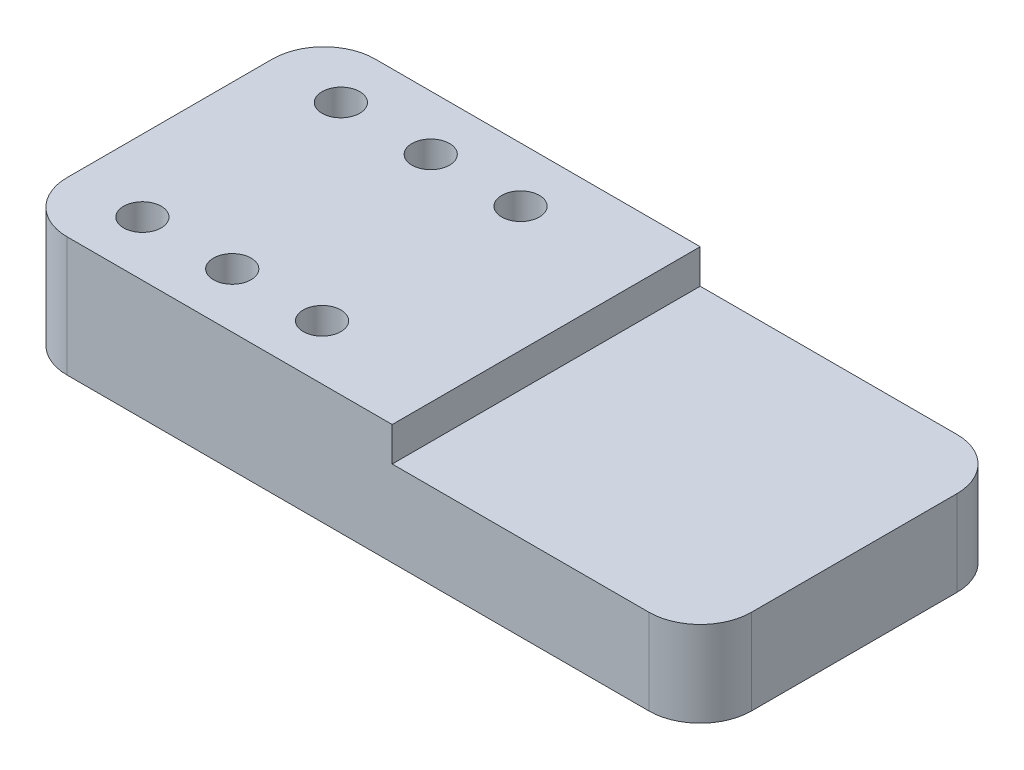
ISO-10303-21;
HEADER;
FILE_DESCRIPTION(('STEP AP214'),'2;1');
FILE_NAME('part.step','',(''),(''),'','','');
FILE_SCHEMA(('AUTOMOTIVE_DESIGN { 1 0 10303 214 1 1 1 1 }'));
ENDSEC;
DATA;
#1=APPLICATION_CONTEXT('core data for automotive mechanical design processes');
#2=APPLICATION_PROTOCOL_DEFINITION('international standard','automotive_design',2000,#1);
#3=PRODUCT_CONTEXT('',#1,'mechanical');
#4=PRODUCT('Part','Part','',(#3));
#5=PRODUCT_RELATED_PRODUCT_CATEGORY('part','',(#4));
#6=PRODUCT_DEFINITION_FORMATION('','',#4);
#7=PRODUCT_DEFINITION_CONTEXT('part definition',#1,'design');
#8=PRODUCT_DEFINITION('design','',#6,#7);
#9=PRODUCT_DEFINITION_SHAPE('','',#8);
#10=(LENGTH_UNIT() NAMED_UNIT(*) SI_UNIT(.MILLI.,.METRE.));
#11=(NAMED_UNIT(*) PLANE_ANGLE_UNIT() SI_UNIT($,.RADIAN.));
#12=(NAMED_UNIT(*) SI_UNIT($,.STERADIAN.) SOLID_ANGLE_UNIT());
#13=UNCERTAINTY_MEASURE_WITH_UNIT(LENGTH_MEASURE(1.E-05),#10,'distance_accuracy_value','');
#14=(GEOMETRIC_REPRESENTATION_CONTEXT(3) GLOBAL_UNCERTAINTY_ASSIGNED_CONTEXT((#13)) GLOBAL_UNIT_ASSIGNED_CONTEXT((#10,
#11,#12)) REPRESENTATION_CONTEXT('',''));
#15=CARTESIAN_POINT('',(0.,0.,0.));
#16=DIRECTION('',(0.,0.,1.));
#17=DIRECTION('',(1.,0.,0.));
#18=AXIS2_PLACEMENT_3D('',#15,#16,#17);
#19=CARTESIAN_POINT('',(-200.,70.,90.));
#20=DIRECTION('',(1.,0.,0.));
#21=DIRECTION('',(0.,0.,-1.));
#22=AXIS2_PLACEMENT_3D('',#19,#20,#21);
#23=PLANE('',#22);
#24=DIRECTION('',(0.,0.,-1.));
#25=VECTOR('',#24,1.);
#26=CARTESIAN_POINT('',(-200.,70.,90.));
#27=LINE('',#26,#25);
#28=CARTESIAN_POINT('',(-200.,70.,60.000000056));
#29=VERTEX_POINT('',#28);
#30=CARTESIAN_POINT('',(-200.,70.,-60.000000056));
#31=VERTEX_POINT('',#30);
#32=EDGE_CURVE('E141',#29,#31,#27,.T.);
#33=ORIENTED_EDGE('',*,*,#32,.T.);
#34=DIRECTION('',(0.,-1.,0.));
#35=VECTOR('',#34,1.);
#36=CARTESIAN_POINT('',(-200.,70.,-60.000000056));
#37=LINE('',#36,#35);
#38=CARTESIAN_POINT('',(-200.,0.,-60.000000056));
#39=VERTEX_POINT('',#38);
#40=EDGE_CURVE('E190',#31,#39,#37,.T.);
#41=ORIENTED_EDGE('',*,*,#40,.T.);
#42=DIRECTION('',(0.,0.,-1.));
#43=VECTOR('',#42,1.);
#44=CARTESIAN_POINT('',(-200.,0.,90.));
#45=LINE('',#44,#43);
#46=CARTESIAN_POINT('',(-200.,0.,60.000000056));
#47=VERTEX_POINT('',#46);
#48=EDGE_CURVE('E161',#47,#39,#45,.T.);
#49=ORIENTED_EDGE('',*,*,#48,.F.);
#50=DIRECTION('',(0.,-1.,0.));
#51=VECTOR('',#50,1.);
#52=CARTESIAN_POINT('',(-200.,70.,60.000000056));
#53=LINE('',#52,#51);
#54=EDGE_CURVE('E56',#47,#29,#53,.F.);
#55=ORIENTED_EDGE('',*,*,#54,.T.);
#56=EDGE_LOOP('',(#33,#41,#49,#55));
#57=FACE_BOUND('',#56,.T.);
#58=ADVANCED_FACE('F36',(#57),#23,.F.);
#59=CARTESIAN_POINT('',(-200.,0.,90.));
#60=DIRECTION('',(0.,1.,0.));
#61=DIRECTION('',(0.,0.,1.));
#62=AXIS2_PLACEMENT_3D('',#59,#60,#61);
#63=PLANE('',#62);
#64=DIRECTION('',(0.,0.,-1.));
#65=VECTOR('',#64,1.);
#66=CARTESIAN_POINT('',(200.,0.,90.));
#67=LINE('',#66,#65);
#68=CARTESIAN_POINT('',(200.,0.,60.000000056));
#69=VERTEX_POINT('',#68);
#70=CARTESIAN_POINT('',(200.,0.,-60.000000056));
#71=VERTEX_POINT('',#70);
#72=EDGE_CURVE('E158',#69,#71,#67,.T.);
#73=ORIENTED_EDGE('',*,*,#72,.F.);
#74=CARTESIAN_POINT('',(170.000000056,0.,60.000000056));
#75=DIRECTION('',(0.,1.,0.));
#76=DIRECTION('',(0.,0.,1.));
#77=AXIS2_PLACEMENT_3D('',#74,#75,#76);
#78=CIRCLE('',#77,29.999999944);
#79=CARTESIAN_POINT('',(170.000000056,0.,90.));
#80=VERTEX_POINT('',#79);
#81=EDGE_CURVE('E183',#69,#80,#78,.F.);
#82=ORIENTED_EDGE('',*,*,#81,.T.);
#83=DIRECTION('',(1.,0.,0.));
#84=VECTOR('',#83,1.);
#85=CARTESIAN_POINT('',(-200.,0.,90.));
#86=LINE('',#85,#84);
#87=CARTESIAN_POINT('',(-170.000000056,0.,90.));
#88=VERTEX_POINT('',#87);
#89=EDGE_CURVE('E124',#88,#80,#86,.T.);
#90=ORIENTED_EDGE('',*,*,#89,.F.);
#91=CARTESIAN_POINT('',(-170.000000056,0.,60.000000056));
#92=DIRECTION('',(0.,1.,0.));
#93=DIRECTION('',(0.,0.,1.));
#94=AXIS2_PLACEMENT_3D('',#91,#92,#93);
#95=CIRCLE('',#94,29.999999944);
#96=EDGE_CURVE('E177',#88,#47,#95,.F.);
#97=ORIENTED_EDGE('',*,*,#96,.T.);
#98=ORIENTED_EDGE('',*,*,#48,.T.);
#99=CARTESIAN_POINT('',(-170.000000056,0.,-60.000000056));
#100=DIRECTION('',(0.,1.,0.));
#101=DIRECTION('',(0.,0.,1.));
#102=AXIS2_PLACEMENT_3D('',#99,#100,#101);
#103=CIRCLE('',#102,29.999999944);
#104=CARTESIAN_POINT('',(-170.000000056,0.,-90.));
#105=VERTEX_POINT('',#104);
#106=EDGE_CURVE('E179',#39,#105,#103,.F.);
#107=ORIENTED_EDGE('',*,*,#106,.T.);
#108=DIRECTION('',(1.,0.,0.));
#109=VECTOR('',#108,1.);
#110=CARTESIAN_POINT('',(-200.,0.,-90.));
#111=LINE('',#110,#109);
#112=CARTESIAN_POINT('',(170.000000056,0.,-90.));
#113=VERTEX_POINT('',#112);
#114=EDGE_CURVE('E145',#105,#113,#111,.T.);
#115=ORIENTED_EDGE('',*,*,#114,.T.);
#116=CARTESIAN_POINT('',(170.000000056,0.,-60.000000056));
#117=DIRECTION('',(0.,1.,0.));
#118=DIRECTION('',(0.,0.,1.));
#119=AXIS2_PLACEMENT_3D('',#116,#117,#118);
#120=CIRCLE('',#119,29.999999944);
#121=EDGE_CURVE('E181',#113,#71,#120,.F.);
#122=ORIENTED_EDGE('',*,*,#121,.T.);
#123=EDGE_LOOP('',(#73,#82,#90,#97,#98,#107,#115,#122));
#124=FACE_BOUND('',#123,.T.);
#125=ADVANCED_FACE('F199',(#124),#63,.F.);
#126=CARTESIAN_POINT('',(200.,50.,90.));
#127=DIRECTION('',(-1.,0.,0.));
#128=DIRECTION('',(0.,0.,1.));
#129=AXIS2_PLACEMENT_3D('',#126,#127,#128);
#130=PLANE('',#129);
#131=DIRECTION('',(0.,0.,-1.));
#132=VECTOR('',#131,1.);
#133=CARTESIAN_POINT('',(200.,50.,90.));
#134=LINE('',#133,#132);
#135=CARTESIAN_POINT('',(200.,50.,60.000000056));
#136=VERTEX_POINT('',#135);
#137=CARTESIAN_POINT('',(200.,50.,-60.000000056));
#138=VERTEX_POINT('',#137);
#139=EDGE_CURVE('E133',#136,#138,#134,.T.);
#140=ORIENTED_EDGE('',*,*,#139,.F.);
#141=DIRECTION('',(0.,1.,0.));
#142=VECTOR('',#141,1.);
#143=CARTESIAN_POINT('',(200.,0.,60.000000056));
#144=LINE('',#143,#142);
#145=EDGE_CURVE('E175',#136,#69,#144,.F.);
#146=ORIENTED_EDGE('',*,*,#145,.T.);
#147=ORIENTED_EDGE('',*,*,#72,.T.);
#148=DIRECTION('',(0.,1.,0.));
#149=VECTOR('',#148,1.);
#150=CARTESIAN_POINT('',(200.,50.,-60.000000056));
#151=LINE('',#150,#149);
#152=EDGE_CURVE('E172',#71,#138,#151,.T.);
#153=ORIENTED_EDGE('',*,*,#152,.T.);
#154=EDGE_LOOP('',(#140,#146,#147,#153));
#155=FACE_BOUND('',#154,.T.);
#156=ADVANCED_FACE('F216',(#155),#130,.F.);
#157=CARTESIAN_POINT('',(20.,50.,90.));
#158=DIRECTION('',(0.,-1.,0.));
#159=DIRECTION('',(0.,0.,-1.));
#160=AXIS2_PLACEMENT_3D('',#157,#158,#159);
#161=PLANE('',#160);
#162=DIRECTION('',(-1.,0.,0.));
#163=VECTOR('',#162,1.);
#164=CARTESIAN_POINT('',(20.,50.,90.));
#165=LINE('',#164,#163);
#166=CARTESIAN_POINT('',(170.000000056,50.,90.));
#167=VERTEX_POINT('',#166);
#168=CARTESIAN_POINT('',(20.,50.,90.));
#169=VERTEX_POINT('',#168);
#170=EDGE_CURVE('E113',#167,#169,#165,.T.);
#171=ORIENTED_EDGE('',*,*,#170,.F.);
#172=CARTESIAN_POINT('',(170.000000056,50.,60.000000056));
#173=DIRECTION('',(0.,-1.,0.));
#174=DIRECTION('',(0.,0.,-1.));
#175=AXIS2_PLACEMENT_3D('',#172,#173,#174);
#176=CIRCLE('',#175,29.999999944);
#177=EDGE_CURVE('E170',#167,#136,#176,.F.);
#178=ORIENTED_EDGE('',*,*,#177,.T.);
#179=ORIENTED_EDGE('',*,*,#139,.T.);
#180=CARTESIAN_POINT('',(170.000000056,50.,-60.000000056));
#181=DIRECTION('',(0.,-1.,0.));
#182=DIRECTION('',(0.,0.,-1.));
#183=AXIS2_PLACEMENT_3D('',#180,#181,#182);
#184=CIRCLE('',#183,29.999999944);
#185=CARTESIAN_POINT('',(170.000000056,50.,-90.));
#186=VERTEX_POINT('',#185);
#187=EDGE_CURVE('E168',#138,#186,#184,.F.);
#188=ORIENTED_EDGE('',*,*,#187,.T.);
#189=DIRECTION('',(-1.,0.,0.));
#190=VECTOR('',#189,1.);
#191=CARTESIAN_POINT('',(20.,50.,-90.));
#192=LINE('',#191,#190);
#193=CARTESIAN_POINT('',(20.,50.,-90.));
#194=VERTEX_POINT('',#193);
#195=EDGE_CURVE('E130',#186,#194,#192,.T.);
#196=ORIENTED_EDGE('',*,*,#195,.T.);
#197=DIRECTION('',(0.,0.,-1.));
#198=VECTOR('',#197,1.);
#199=CARTESIAN_POINT('',(20.,50.,90.));
#200=LINE('',#199,#198);
#201=EDGE_CURVE('E127',#169,#194,#200,.T.);
#202=ORIENTED_EDGE('',*,*,#201,.F.);
#203=EDGE_LOOP('',(#171,#178,#179,#188,#196,#202));
#204=FACE_BOUND('',#203,.T.);
#205=ADVANCED_FACE('F128',(#204),#161,.F.);
#206=CARTESIAN_POINT('',(20.,70.,90.));
#207=DIRECTION('',(-1.,0.,0.));
#208=DIRECTION('',(0.,-1.,0.));
#209=AXIS2_PLACEMENT_3D('',#206,#207,#208);
#210=PLANE('',#209);
#211=DIRECTION('',(0.,1.,0.));
#212=VECTOR('',#211,1.);
#213=CARTESIAN_POINT('',(20.,70.,-90.));
#214=LINE('',#213,#212);
#215=CARTESIAN_POINT('',(20.,70.,-90.));
#216=VERTEX_POINT('',#215);
#217=EDGE_CURVE('E150',#194,#216,#214,.T.);
#218=ORIENTED_EDGE('',*,*,#217,.T.);
#219=DIRECTION('',(0.,0.,-1.));
#220=VECTOR('',#219,1.);
#221=CARTESIAN_POINT('',(20.,70.,90.));
#222=LINE('',#221,#220);
#223=CARTESIAN_POINT('',(20.,70.,90.));
#224=VERTEX_POINT('',#223);
#225=EDGE_CURVE('E134',#224,#216,#222,.T.);
#226=ORIENTED_EDGE('',*,*,#225,.F.);
#227=DIRECTION('',(0.,1.,0.));
#228=VECTOR('',#227,1.);
#229=CARTESIAN_POINT('',(20.,70.,90.));
#230=LINE('',#229,#228);
#231=EDGE_CURVE('E119',#169,#224,#230,.T.);
#232=ORIENTED_EDGE('',*,*,#231,.F.);
#233=ORIENTED_EDGE('',*,*,#201,.T.);
#234=EDGE_LOOP('',(#218,#226,#232,#233));
#235=FACE_BOUND('',#234,.T.);
#236=ADVANCED_FACE('F136',(#235),#210,.F.);
#237=CARTESIAN_POINT('',(-200.,70.,90.));
#238=DIRECTION('',(0.,-1.,0.));
#239=DIRECTION('',(0.,0.,-1.));
#240=AXIS2_PLACEMENT_3D('',#237,#238,#239);
#241=PLANE('',#240);
#242=CARTESIAN_POINT('',(-158.,70.,-58.));
#243=DIRECTION('',(0.,1.,0.));
#244=DIRECTION('',(0.,0.,1.));
#245=AXIS2_PLACEMENT_3D('',#242,#243,#244);
#246=CIRCLE('',#245,11.);
#247=CARTESIAN_POINT('',(-158.,70.,-47.));
#248=VERTEX_POINT('',#247);
#249=EDGE_CURVE('E253',#248,#248,#246,.T.);
#250=ORIENTED_EDGE('',*,*,#249,.F.);
#251=EDGE_LOOP('',(#250));
#252=FACE_BOUND('',#251,.T.);
#253=CARTESIAN_POINT('',(-105.5,70.,-58.));
#254=DIRECTION('',(0.,1.,0.));
#255=DIRECTION('',(0.,0.,1.));
#256=AXIS2_PLACEMENT_3D('',#253,#254,#255);
#257=CIRCLE('',#256,11.);
#258=CARTESIAN_POINT('',(-105.5,70.,-47.));
#259=VERTEX_POINT('',#258);
#260=EDGE_CURVE('E247',#259,#259,#257,.T.);
#261=ORIENTED_EDGE('',*,*,#260,.F.);
#262=EDGE_LOOP('',(#261));
#263=FACE_BOUND('',#262,.T.);
#264=CARTESIAN_POINT('',(-53.,70.,-58.));
#265=DIRECTION('',(0.,1.,0.));
#266=DIRECTION('',(0.,0.,1.));
#267=AXIS2_PLACEMENT_3D('',#264,#265,#266);
#268=CIRCLE('',#267,11.);
#269=CARTESIAN_POINT('',(-53.,70.,-47.));
#270=VERTEX_POINT('',#269);
#271=EDGE_CURVE('E241',#270,#270,#268,.T.);
#272=ORIENTED_EDGE('',*,*,#271,.F.);
#273=EDGE_LOOP('',(#272));
#274=FACE_BOUND('',#273,.T.);
#275=CARTESIAN_POINT('',(-158.,70.,58.));
#276=DIRECTION('',(0.,1.,0.));
#277=DIRECTION('',(0.,0.,1.));
#278=AXIS2_PLACEMENT_3D('',#275,#276,#277);
#279=CIRCLE('',#278,11.);
#280=CARTESIAN_POINT('',(-158.,70.,69.));
#281=VERTEX_POINT('',#280);
#282=EDGE_CURVE('E235',#281,#281,#279,.T.);
#283=ORIENTED_EDGE('',*,*,#282,.F.);
#284=EDGE_LOOP('',(#283));
#285=FACE_BOUND('',#284,.T.);
#286=CARTESIAN_POINT('',(-53.,70.,58.));
#287=DIRECTION('',(0.,1.,0.));
#288=DIRECTION('',(0.,0.,1.));
#289=AXIS2_PLACEMENT_3D('',#286,#287,#288);
#290=CIRCLE('',#289,11.);
#291=CARTESIAN_POINT('',(-53.,70.,69.));
#292=VERTEX_POINT('',#291);
#293=EDGE_CURVE('E229',#292,#292,#290,.T.);
#294=ORIENTED_EDGE('',*,*,#293,.F.);
#295=EDGE_LOOP('',(#294));
#296=FACE_BOUND('',#295,.T.);
#297=CARTESIAN_POINT('',(-105.5,70.,58.));
#298=DIRECTION('',(0.,1.,0.));
#299=DIRECTION('',(0.,0.,1.));
#300=AXIS2_PLACEMENT_3D('',#297,#298,#299);
#301=CIRCLE('',#300,11.);
#302=CARTESIAN_POINT('',(-105.5,70.,69.));
#303=VERTEX_POINT('',#302);
#304=EDGE_CURVE('E223',#303,#303,#301,.T.);
#305=ORIENTED_EDGE('',*,*,#304,.F.);
#306=EDGE_LOOP('',(#305));
#307=FACE_BOUND('',#306,.T.);
#308=DIRECTION('',(-1.,0.,0.));
#309=VECTOR('',#308,1.);
#310=CARTESIAN_POINT('',(-200.,70.,-90.));
#311=LINE('',#310,#309);
#312=CARTESIAN_POINT('',(-170.000000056,70.,-90.));
#313=VERTEX_POINT('',#312);
#314=EDGE_CURVE('E152',#216,#313,#311,.T.);
#315=ORIENTED_EDGE('',*,*,#314,.T.);
#316=CARTESIAN_POINT('',(-170.000000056,70.,-60.000000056));
#317=DIRECTION('',(0.,-1.,0.));
#318=DIRECTION('',(0.,0.,-1.));
#319=AXIS2_PLACEMENT_3D('',#316,#317,#318);
#320=CIRCLE('',#319,29.999999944);
#321=EDGE_CURVE('E11',#313,#31,#320,.F.);
#322=ORIENTED_EDGE('',*,*,#321,.T.);
#323=ORIENTED_EDGE('',*,*,#32,.F.);
#324=CARTESIAN_POINT('',(-170.000000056,70.,60.000000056));
#325=DIRECTION('',(0.,-1.,0.));
#326=DIRECTION('',(0.,0.,-1.));
#327=AXIS2_PLACEMENT_3D('',#324,#325,#326);
#328=CIRCLE('',#327,29.999999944);
#329=CARTESIAN_POINT('',(-170.000000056,70.,90.));
#330=VERTEX_POINT('',#329);
#331=EDGE_CURVE('E44',#29,#330,#328,.F.);
#332=ORIENTED_EDGE('',*,*,#331,.T.);
#333=DIRECTION('',(-1.,0.,0.));
#334=VECTOR('',#333,1.);
#335=CARTESIAN_POINT('',(-200.,70.,90.));
#336=LINE('',#335,#334);
#337=EDGE_CURVE('E139',#224,#330,#336,.T.);
#338=ORIENTED_EDGE('',*,*,#337,.F.);
#339=ORIENTED_EDGE('',*,*,#225,.T.);
#340=EDGE_LOOP('',(#315,#322,#323,#332,#338,#339));
#341=FACE_BOUND('',#340,.T.);
#342=ADVANCED_FACE('F193',(#252,#263,#274,#285,#296,#307,#341),#241,.F.);
#343=CARTESIAN_POINT('',(0.,0.,90.));
#344=DIRECTION('',(0.,0.,1.));
#345=DIRECTION('',(1.,0.,0.));
#346=AXIS2_PLACEMENT_3D('',#343,#344,#345);
#347=PLANE('',#346);
#348=ORIENTED_EDGE('',*,*,#89,.T.);
#349=DIRECTION('',(0.,1.,0.));
#350=VECTOR('',#349,1.);
#351=CARTESIAN_POINT('',(170.000000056,50.,90.));
#352=LINE('',#351,#350);
#353=EDGE_CURVE('E122',#80,#167,#352,.T.);
#354=ORIENTED_EDGE('',*,*,#353,.T.);
#355=ORIENTED_EDGE('',*,*,#170,.T.);
#356=ORIENTED_EDGE('',*,*,#231,.T.);
#357=ORIENTED_EDGE('',*,*,#337,.T.);
#358=DIRECTION('',(0.,-1.,0.));
#359=VECTOR('',#358,1.);
#360=CARTESIAN_POINT('',(-170.000000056,0.,90.));
#361=LINE('',#360,#359);
#362=EDGE_CURVE('E164',#330,#88,#361,.T.);
#363=ORIENTED_EDGE('',*,*,#362,.T.);
#364=EDGE_LOOP('',(#348,#354,#355,#356,#357,#363));
#365=FACE_BOUND('',#364,.T.);
#366=ADVANCED_FACE('F116',(#365),#347,.T.);
#367=CARTESIAN_POINT('',(0.,0.,-90.));
#368=DIRECTION('',(0.,0.,1.));
#369=DIRECTION('',(1.,0.,0.));
#370=AXIS2_PLACEMENT_3D('',#367,#368,#369);
#371=PLANE('',#370);
#372=ORIENTED_EDGE('',*,*,#195,.F.);
#373=DIRECTION('',(0.,1.,0.));
#374=VECTOR('',#373,1.);
#375=CARTESIAN_POINT('',(170.000000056,0.,-90.));
#376=LINE('',#375,#374);
#377=EDGE_CURVE('E187',#186,#113,#376,.F.);
#378=ORIENTED_EDGE('',*,*,#377,.T.);
#379=ORIENTED_EDGE('',*,*,#114,.F.);
#380=DIRECTION('',(0.,-1.,0.));
#381=VECTOR('',#380,1.);
#382=CARTESIAN_POINT('',(-170.000000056,0.,-90.));
#383=LINE('',#382,#381);
#384=EDGE_CURVE('E185',#105,#313,#383,.F.);
#385=ORIENTED_EDGE('',*,*,#384,.T.);
#386=ORIENTED_EDGE('',*,*,#314,.F.);
#387=ORIENTED_EDGE('',*,*,#217,.F.);
#388=EDGE_LOOP('',(#372,#378,#379,#385,#386,#387));
#389=FACE_BOUND('',#388,.T.);
#390=ADVANCED_FACE('F207',(#389),#371,.F.);
#391=CARTESIAN_POINT('',(170.000000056,0.,60.000000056));
#392=DIRECTION('',(0.,-1.,0.));
#393=DIRECTION('',(0.,0.,-1.));
#394=AXIS2_PLACEMENT_3D('',#391,#392,#393);
#395=CYLINDRICAL_SURFACE('',#394,29.999999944);
#396=ORIENTED_EDGE('',*,*,#81,.F.);
#397=ORIENTED_EDGE('',*,*,#145,.F.);
#398=ORIENTED_EDGE('',*,*,#177,.F.);
#399=ORIENTED_EDGE('',*,*,#353,.F.);
#400=EDGE_LOOP('',(#396,#397,#398,#399));
#401=FACE_BOUND('',#400,.T.);
#402=ADVANCED_FACE('F219',(#401),#395,.T.);
#403=CARTESIAN_POINT('',(170.000000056,50.,-60.000000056));
#404=DIRECTION('',(0.,1.,0.));
#405=DIRECTION('',(0.,0.,1.));
#406=AXIS2_PLACEMENT_3D('',#403,#404,#405);
#407=CYLINDRICAL_SURFACE('',#406,29.999999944);
#408=ORIENTED_EDGE('',*,*,#121,.F.);
#409=ORIENTED_EDGE('',*,*,#377,.F.);
#410=ORIENTED_EDGE('',*,*,#187,.F.);
#411=ORIENTED_EDGE('',*,*,#152,.F.);
#412=EDGE_LOOP('',(#408,#409,#410,#411));
#413=FACE_BOUND('',#412,.T.);
#414=ADVANCED_FACE('F211',(#413),#407,.T.);
#415=CARTESIAN_POINT('',(-170.000000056,70.,-60.000000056));
#416=DIRECTION('',(0.,-1.,0.));
#417=DIRECTION('',(0.,0.,-1.));
#418=AXIS2_PLACEMENT_3D('',#415,#416,#417);
#419=CYLINDRICAL_SURFACE('',#418,29.999999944);
#420=ORIENTED_EDGE('',*,*,#321,.F.);
#421=ORIENTED_EDGE('',*,*,#384,.F.);
#422=ORIENTED_EDGE('',*,*,#106,.F.);
#423=ORIENTED_EDGE('',*,*,#40,.F.);
#424=EDGE_LOOP('',(#420,#421,#422,#423));
#425=FACE_BOUND('',#424,.T.);
#426=ADVANCED_FACE('F202',(#425),#419,.T.);
#427=CARTESIAN_POINT('',(-170.000000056,0.,60.000000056));
#428=DIRECTION('',(0.,1.,0.));
#429=DIRECTION('',(0.,0.,1.));
#430=AXIS2_PLACEMENT_3D('',#427,#428,#429);
#431=CYLINDRICAL_SURFACE('',#430,29.999999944);
#432=ORIENTED_EDGE('',*,*,#331,.F.);
#433=ORIENTED_EDGE('',*,*,#54,.F.);
#434=ORIENTED_EDGE('',*,*,#96,.F.);
#435=ORIENTED_EDGE('',*,*,#362,.F.);
#436=EDGE_LOOP('',(#432,#433,#434,#435));
#437=FACE_BOUND('',#436,.T.);
#438=ADVANCED_FACE('F38',(#437),#431,.T.);
#439=CARTESIAN_POINT('',(-105.5,14.882,58.));
#440=DIRECTION('',(0.,-1.,0.));
#441=DIRECTION('',(0.,0.,-1.));
#442=AXIS2_PLACEMENT_3D('',#439,#440,#441);
#443=PLANE('',#442);
#444=CARTESIAN_POINT('',(-105.5,14.882,58.));
#445=DIRECTION('',(0.,1.,0.));
#446=DIRECTION('',(0.,0.,1.));
#447=AXIS2_PLACEMENT_3D('',#444,#445,#446);
#448=CIRCLE('',#447,11.);
#449=CARTESIAN_POINT('',(-105.5,14.882,69.));
#450=VERTEX_POINT('',#449);
#451=EDGE_CURVE('E148',#450,#450,#448,.T.);
#452=ORIENTED_EDGE('',*,*,#451,.T.);
#453=EDGE_LOOP('',(#452));
#454=FACE_BOUND('',#453,.T.);
#455=ADVANCED_FACE('F275',(#454),#443,.F.);
#456=CARTESIAN_POINT('',(-105.5,70.,58.));
#457=DIRECTION('',(0.,1.,0.));
#458=DIRECTION('',(0.,0.,1.));
#459=AXIS2_PLACEMENT_3D('',#456,#457,#458);
#460=CYLINDRICAL_SURFACE('',#459,11.);
#461=ORIENTED_EDGE('',*,*,#451,.F.);
#462=EDGE_LOOP('',(#461));
#463=FACE_BOUND('',#462,.T.);
#464=ORIENTED_EDGE('',*,*,#304,.T.);
#465=EDGE_LOOP('',(#464));
#466=FACE_BOUND('',#465,.T.);
#467=ADVANCED_FACE('F272',(#463,#466),#460,.F.);
#468=CARTESIAN_POINT('',(-53.,14.882,58.));
#469=DIRECTION('',(0.,-1.,0.));
#470=DIRECTION('',(0.,0.,-1.));
#471=AXIS2_PLACEMENT_3D('',#468,#469,#470);
#472=PLANE('',#471);
#473=CARTESIAN_POINT('',(-53.,14.882,58.));
#474=DIRECTION('',(0.,1.,0.));
#475=DIRECTION('',(0.,0.,1.));
#476=AXIS2_PLACEMENT_3D('',#473,#474,#475);
#477=CIRCLE('',#476,11.);
#478=CARTESIAN_POINT('',(-53.,14.882,69.));
#479=VERTEX_POINT('',#478);
#480=EDGE_CURVE('E226',#479,#479,#477,.T.);
#481=ORIENTED_EDGE('',*,*,#480,.T.);
#482=EDGE_LOOP('',(#481));
#483=FACE_BOUND('',#482,.T.);
#484=ADVANCED_FACE('F274',(#483),#472,.F.);
#485=CARTESIAN_POINT('',(-53.,70.,58.));
#486=DIRECTION('',(0.,1.,0.));
#487=DIRECTION('',(0.,0.,1.));
#488=AXIS2_PLACEMENT_3D('',#485,#486,#487);
#489=CYLINDRICAL_SURFACE('',#488,11.);
#490=ORIENTED_EDGE('',*,*,#480,.F.);
#491=EDGE_LOOP('',(#490));
#492=FACE_BOUND('',#491,.T.);
#493=ORIENTED_EDGE('',*,*,#293,.T.);
#494=EDGE_LOOP('',(#493));
#495=FACE_BOUND('',#494,.T.);
#496=ADVANCED_FACE('F282',(#492,#495),#489,.F.);
#497=CARTESIAN_POINT('',(-158.,14.882,58.));
#498=DIRECTION('',(0.,-1.,0.));
#499=DIRECTION('',(0.,0.,-1.));
#500=AXIS2_PLACEMENT_3D('',#497,#498,#499);
#501=PLANE('',#500);
#502=CARTESIAN_POINT('',(-158.,14.882,58.));
#503=DIRECTION('',(0.,1.,0.));
#504=DIRECTION('',(0.,0.,1.));
#505=AXIS2_PLACEMENT_3D('',#502,#503,#504);
#506=CIRCLE('',#505,11.);
#507=CARTESIAN_POINT('',(-158.,14.882,69.));
#508=VERTEX_POINT('',#507);
#509=EDGE_CURVE('E232',#508,#508,#506,.T.);
#510=ORIENTED_EDGE('',*,*,#509,.T.);
#511=EDGE_LOOP('',(#510));
#512=FACE_BOUND('',#511,.T.);
#513=ADVANCED_FACE('F336',(#512),#501,.F.);
#514=CARTESIAN_POINT('',(-158.,70.,58.));
#515=DIRECTION('',(0.,1.,0.));
#516=DIRECTION('',(0.,0.,1.));
#517=AXIS2_PLACEMENT_3D('',#514,#515,#516);
#518=CYLINDRICAL_SURFACE('',#517,11.);
#519=ORIENTED_EDGE('',*,*,#509,.F.);
#520=EDGE_LOOP('',(#519));
#521=FACE_BOUND('',#520,.T.);
#522=ORIENTED_EDGE('',*,*,#282,.T.);
#523=EDGE_LOOP('',(#522));
#524=FACE_BOUND('',#523,.T.);
#525=ADVANCED_FACE('F348',(#521,#524),#518,.F.);
#526=CARTESIAN_POINT('',(-53.,14.882,-58.));
#527=DIRECTION('',(0.,-1.,0.));
#528=DIRECTION('',(0.,0.,-1.));
#529=AXIS2_PLACEMENT_3D('',#526,#527,#528);
#530=PLANE('',#529);
#531=CARTESIAN_POINT('',(-53.,14.882,-58.));
#532=DIRECTION('',(0.,1.,0.));
#533=DIRECTION('',(0.,0.,1.));
#534=AXIS2_PLACEMENT_3D('',#531,#532,#533);
#535=CIRCLE('',#534,11.);
#536=CARTESIAN_POINT('',(-53.,14.882,-47.));
#537=VERTEX_POINT('',#536);
#538=EDGE_CURVE('E238',#537,#537,#535,.T.);
#539=ORIENTED_EDGE('',*,*,#538,.T.);
#540=EDGE_LOOP('',(#539));
#541=FACE_BOUND('',#540,.T.);
#542=ADVANCED_FACE('F358',(#541),#530,.F.);
#543=CARTESIAN_POINT('',(-53.,70.,-58.));
#544=DIRECTION('',(0.,1.,0.));
#545=DIRECTION('',(0.,0.,1.));
#546=AXIS2_PLACEMENT_3D('',#543,#544,#545);
#547=CYLINDRICAL_SURFACE('',#546,11.);
#548=ORIENTED_EDGE('',*,*,#538,.F.);
#549=EDGE_LOOP('',(#548));
#550=FACE_BOUND('',#549,.T.);
#551=ORIENTED_EDGE('',*,*,#271,.T.);
#552=EDGE_LOOP('',(#551));
#553=FACE_BOUND('',#552,.T.);
#554=ADVANCED_FACE('F369',(#550,#553),#547,.F.);
#555=CARTESIAN_POINT('',(-105.5,14.882,-58.));
#556=DIRECTION('',(0.,-1.,0.));
#557=DIRECTION('',(0.,0.,-1.));
#558=AXIS2_PLACEMENT_3D('',#555,#556,#557);
#559=PLANE('',#558);
#560=CARTESIAN_POINT('',(-105.5,14.882,-58.));
#561=DIRECTION('',(0.,1.,0.));
#562=DIRECTION('',(0.,0.,1.));
#563=AXIS2_PLACEMENT_3D('',#560,#561,#562);
#564=CIRCLE('',#563,11.);
#565=CARTESIAN_POINT('',(-105.5,14.882,-47.));
#566=VERTEX_POINT('',#565);
#567=EDGE_CURVE('E244',#566,#566,#564,.T.);
#568=ORIENTED_EDGE('',*,*,#567,.T.);
#569=EDGE_LOOP('',(#568));
#570=FACE_BOUND('',#569,.T.);
#571=ADVANCED_FACE('F379',(#570),#559,.F.);
#572=CARTESIAN_POINT('',(-105.5,70.,-58.));
#573=DIRECTION('',(0.,1.,0.));
#574=DIRECTION('',(0.,0.,1.));
#575=AXIS2_PLACEMENT_3D('',#572,#573,#574);
#576=CYLINDRICAL_SURFACE('',#575,11.);
#577=ORIENTED_EDGE('',*,*,#567,.F.);
#578=EDGE_LOOP('',(#577));
#579=FACE_BOUND('',#578,.T.);
#580=ORIENTED_EDGE('',*,*,#260,.T.);
#581=EDGE_LOOP('',(#580));
#582=FACE_BOUND('',#581,.T.);
#583=ADVANCED_FACE('F391',(#579,#582),#576,.F.);
#584=CARTESIAN_POINT('',(-158.,14.882,-58.));
#585=DIRECTION('',(0.,-1.,0.));
#586=DIRECTION('',(0.,0.,-1.));
#587=AXIS2_PLACEMENT_3D('',#584,#585,#586);
#588=PLANE('',#587);
#589=CARTESIAN_POINT('',(-158.,14.882,-58.));
#590=DIRECTION('',(0.,1.,0.));
#591=DIRECTION('',(0.,0.,1.));
#592=AXIS2_PLACEMENT_3D('',#589,#590,#591);
#593=CIRCLE('',#592,11.);
#594=CARTESIAN_POINT('',(-158.,14.882,-47.));
#595=VERTEX_POINT('',#594);
#596=EDGE_CURVE('E250',#595,#595,#593,.T.);
#597=ORIENTED_EDGE('',*,*,#596,.T.);
#598=EDGE_LOOP('',(#597));
#599=FACE_BOUND('',#598,.T.);
#600=ADVANCED_FACE('F401',(#599),#588,.F.);
#601=CARTESIAN_POINT('',(-158.,70.,-58.));
#602=DIRECTION('',(0.,1.,0.));
#603=DIRECTION('',(0.,0.,1.));
#604=AXIS2_PLACEMENT_3D('',#601,#602,#603);
#605=CYLINDRICAL_SURFACE('',#604,11.);
#606=ORIENTED_EDGE('',*,*,#596,.F.);
#607=EDGE_LOOP('',(#606));
#608=FACE_BOUND('',#607,.T.);
#609=ORIENTED_EDGE('',*,*,#249,.T.);
#610=EDGE_LOOP('',(#609));
#611=FACE_BOUND('',#610,.T.);
#612=ADVANCED_FACE('F257',(#608,#611),#605,.F.);
#613=CLOSED_SHELL('',(#58,#125,#156,#205,#236,#342,#366,#390,#402,#414,#426,#438,#455,#467,#484,
#496,#513,#525,#542,#554,#571,#583,#600,#612));
#614=MANIFOLD_SOLID_BREP('B2',#613);
#615=ADVANCED_BREP_SHAPE_REPRESENTATION('',(#18,#614),#14);
#616=SHAPE_DEFINITION_REPRESENTATION(#9,#615);
ENDSEC;
END-ISO-10303-21;
